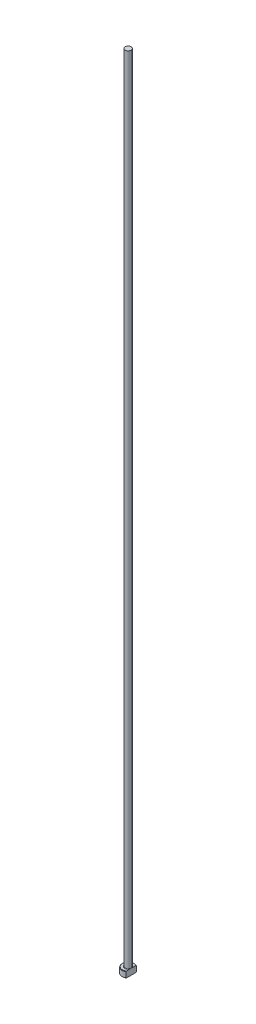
from build123d import *
from build123d.topology import SkipClean

# Parameters (mm, degrees)
CHAMFER1_SIZE = 0.2
FILLET1_R     = 0.2
KEY_DEPTH     = 401.022499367


with BuildPart() as part:
    # Sketch1 → Revolve1 (revolve)
    with BuildSketch(Plane.XY, mode=Mode.PRIVATE) as revolve1_sk:
        Polygon((0, 0), (-3, 0), (-3, 3), (-1.5, 3), (-1.5, 400), (0, 400), align=None)
    revolve(revolve1_sk.sketch.rotate(Axis((0, 259.958771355, 0), (0, -1, 0)), 270), axis=Axis((0, 259.958771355, 0), (0, -1, 0)))

    # Chamfer1
    chamfer1_edges = [part.edges().sort_by_distance(p)[0] for p in [
        (0, 3, -3),
        (0, 0, -3),
    ]]
    chamfer(chamfer1_edges, length=CHAMFER1_SIZE)

    # Fillet1
    fillet1_edges = [part.edges().sort_by_distance(p)[0] for p in [
        (0, 3, -1.5),
    ]]
    fillet(fillet1_edges, radius=FILLET1_R)

    # Sketch2 → KEY (cut, through all)
    with SkipClean():  # the faces are left unmerged after this step: merging them gives an invalid solid
        with BuildSketch(Plane(origin=(0, 0, 0), x_dir=(1, 0, 0), z_dir=(0, 1, 0))):
            with BuildLine():
                Line((1.5, 2.598076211), (1.5, -2.598076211))
                ThreePointArc((1.5, -2.598076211), (3, 0), (1.5, 2.598076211))
            make_face()
        extrude(amount=KEY_DEPTH, mode=Mode.SUBTRACT)


solid = part.part
